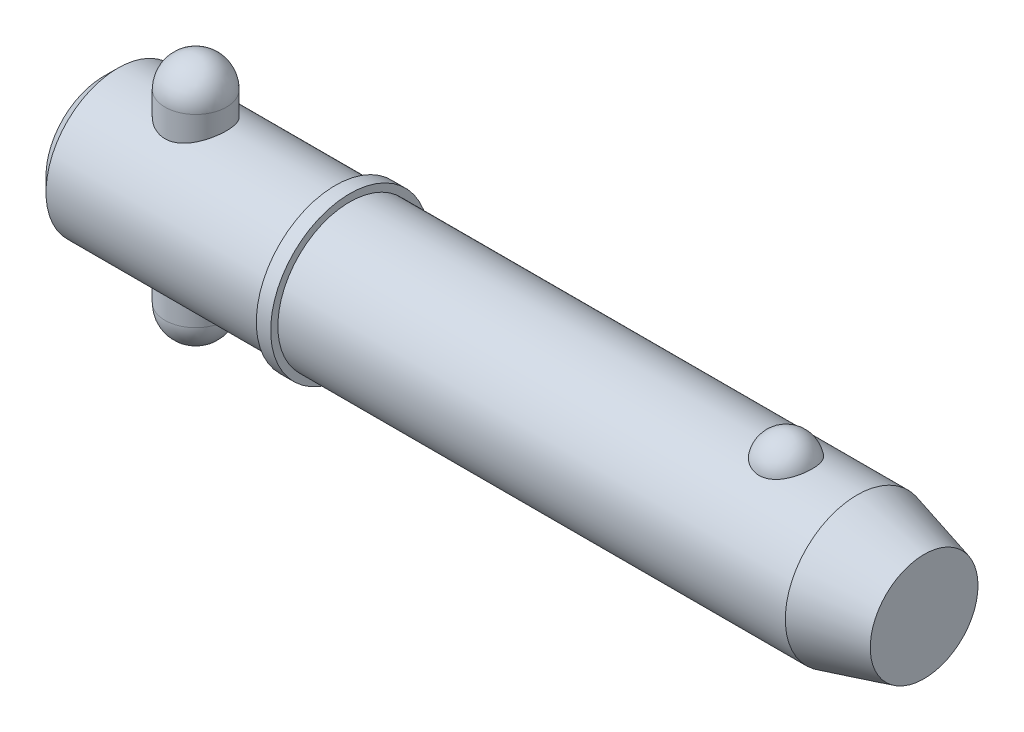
ISO-10303-21;
HEADER;
FILE_DESCRIPTION(('STEP AP214'),'2;1');
FILE_NAME('part.step','',(''),(''),'','','');
FILE_SCHEMA(('AUTOMOTIVE_DESIGN { 1 0 10303 214 1 1 1 1 }'));
ENDSEC;
DATA;
#1=APPLICATION_CONTEXT('core data for automotive mechanical design processes');
#2=APPLICATION_PROTOCOL_DEFINITION('international standard','automotive_design',2000,#1);
#3=PRODUCT_CONTEXT('',#1,'mechanical');
#4=PRODUCT('Part','Part','',(#3));
#5=PRODUCT_RELATED_PRODUCT_CATEGORY('part','',(#4));
#6=PRODUCT_DEFINITION_FORMATION('','',#4);
#7=PRODUCT_DEFINITION_CONTEXT('part definition',#1,'design');
#8=PRODUCT_DEFINITION('design','',#6,#7);
#9=PRODUCT_DEFINITION_SHAPE('','',#8);
#10=(LENGTH_UNIT() NAMED_UNIT(*) SI_UNIT(.MILLI.,.METRE.));
#11=(NAMED_UNIT(*) PLANE_ANGLE_UNIT() SI_UNIT($,.RADIAN.));
#12=(NAMED_UNIT(*) SI_UNIT($,.STERADIAN.) SOLID_ANGLE_UNIT());
#13=UNCERTAINTY_MEASURE_WITH_UNIT(LENGTH_MEASURE(1.E-05),#10,'distance_accuracy_value','');
#14=(GEOMETRIC_REPRESENTATION_CONTEXT(3) GLOBAL_UNCERTAINTY_ASSIGNED_CONTEXT((#13)) GLOBAL_UNIT_ASSIGNED_CONTEXT((#10,
#11,#12)) REPRESENTATION_CONTEXT('',''));
#15=CARTESIAN_POINT('',(0.,0.,0.));
#16=DIRECTION('',(0.,0.,1.));
#17=DIRECTION('',(1.,0.,0.));
#18=AXIS2_PLACEMENT_3D('',#15,#16,#17);
#19=CARTESIAN_POINT('',(14.28,19.05,0.));
#20=DIRECTION('',(0.,-1.,0.));
#21=DIRECTION('',(0.,0.,-1.));
#22=AXIS2_PLACEMENT_3D('',#19,#20,#21);
#23=CYLINDRICAL_SURFACE('',#22,4.76);
#24=CARTESIAN_POINT('',(14.28,-14.29,0.));
#25=DIRECTION('',(0.,-1.,0.));
#26=DIRECTION('',(0.,0.,-1.));
#27=AXIS2_PLACEMENT_3D('',#24,#25,#26);
#28=CIRCLE('',#27,4.76);
#29=CARTESIAN_POINT('',(14.28,-14.29,-4.76));
#30=VERTEX_POINT('',#29);
#31=EDGE_CURVE('P0_E10',#30,#30,#28,.F.);
#32=CARTESIAN_POINT('',(14.28,14.29,0.));
#33=DIRECTION('',(0.,-1.,0.));
#34=DIRECTION('',(0.,0.,-1.));
#35=AXIS2_PLACEMENT_3D('',#32,#33,#34);
#36=CIRCLE('',#35,4.76);
#37=CARTESIAN_POINT('',(14.28,14.29,-4.76));
#38=VERTEX_POINT('',#37);
#39=EDGE_CURVE('P0_E21',#38,#38,#36,.T.);
#40=CARTESIAN_POINT('',(14.28,-14.29,-4.76));
#41=CARTESIAN_POINT('',(14.28,-13.9922916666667,-4.76));
#42=CARTESIAN_POINT('',(14.28,-13.6945833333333,-4.76));
#43=CARTESIAN_POINT('',(14.28,-13.0991666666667,-4.76));
#44=CARTESIAN_POINT('',(14.28,-12.8014583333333,-4.76));
#45=CARTESIAN_POINT('',(14.28,-12.2060416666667,-4.76));
#46=CARTESIAN_POINT('',(14.28,-11.9083333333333,-4.76));
#47=CARTESIAN_POINT('',(14.28,-11.3129166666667,-4.76));
#48=CARTESIAN_POINT('',(14.28,-11.0152083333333,-4.76));
#49=CARTESIAN_POINT('',(14.28,-10.4197916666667,-4.76));
#50=CARTESIAN_POINT('',(14.28,-10.1220833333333,-4.76));
#51=CARTESIAN_POINT('',(14.28,-9.52666666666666,-4.76));
#52=CARTESIAN_POINT('',(14.28,-9.22895833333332,-4.76));
#53=CARTESIAN_POINT('',(14.28,-8.63354166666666,-4.76));
#54=CARTESIAN_POINT('',(14.28,-8.33583333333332,-4.76));
#55=CARTESIAN_POINT('',(14.28,-7.74041666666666,-4.76));
#56=CARTESIAN_POINT('',(14.28,-7.44270833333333,-4.76));
#57=CARTESIAN_POINT('',(14.28,-6.84729166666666,-4.76));
#58=CARTESIAN_POINT('',(14.28,-6.54958333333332,-4.76));
#59=CARTESIAN_POINT('',(14.28,-5.95416666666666,-4.76));
#60=CARTESIAN_POINT('',(14.28,-5.65645833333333,-4.76));
#61=CARTESIAN_POINT('',(14.28,-5.06104166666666,-4.76));
#62=CARTESIAN_POINT('',(14.28,-4.76333333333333,-4.76));
#63=CARTESIAN_POINT('',(14.28,-4.16791666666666,-4.76));
#64=CARTESIAN_POINT('',(14.28,-3.87020833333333,-4.76));
#65=CARTESIAN_POINT('',(14.28,-3.27479166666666,-4.76));
#66=CARTESIAN_POINT('',(14.28,-2.97708333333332,-4.76));
#67=CARTESIAN_POINT('',(14.28,-2.38166666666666,-4.76));
#68=CARTESIAN_POINT('',(14.28,-2.08395833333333,-4.76));
#69=CARTESIAN_POINT('',(14.28,-1.48854166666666,-4.76));
#70=CARTESIAN_POINT('',(14.28,-1.19083333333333,-4.76));
#71=CARTESIAN_POINT('',(14.28,-0.595416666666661,-4.76));
#72=CARTESIAN_POINT('',(14.28,-0.297708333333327,-4.76));
#73=CARTESIAN_POINT('',(14.28,0.297708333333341,-4.76));
#74=CARTESIAN_POINT('',(14.28,0.595416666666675,-4.76));
#75=CARTESIAN_POINT('',(14.28,1.19083333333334,-4.76));
#76=CARTESIAN_POINT('',(14.28,1.48854166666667,-4.76));
#77=CARTESIAN_POINT('',(14.28,2.08395833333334,-4.76));
#78=CARTESIAN_POINT('',(14.28,2.38166666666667,-4.76));
#79=CARTESIAN_POINT('',(14.28,2.97708333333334,-4.76));
#80=CARTESIAN_POINT('',(14.28,3.27479166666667,-4.76));
#81=CARTESIAN_POINT('',(14.28,3.87020833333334,-4.76));
#82=CARTESIAN_POINT('',(14.28,4.16791666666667,-4.76));
#83=CARTESIAN_POINT('',(14.28,4.76333333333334,-4.76));
#84=CARTESIAN_POINT('',(14.28,5.06104166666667,-4.76));
#85=CARTESIAN_POINT('',(14.28,5.65645833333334,-4.76));
#86=CARTESIAN_POINT('',(14.28,5.95416666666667,-4.76));
#87=CARTESIAN_POINT('',(14.28,6.54958333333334,-4.76));
#88=CARTESIAN_POINT('',(14.28,6.84729166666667,-4.76));
#89=CARTESIAN_POINT('',(14.28,7.44270833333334,-4.76));
#90=CARTESIAN_POINT('',(14.28,7.74041666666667,-4.76));
#91=CARTESIAN_POINT('',(14.28,8.33583333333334,-4.76));
#92=CARTESIAN_POINT('',(14.28,8.63354166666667,-4.76));
#93=CARTESIAN_POINT('',(14.28,9.22895833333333,-4.76));
#94=CARTESIAN_POINT('',(14.28,9.52666666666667,-4.76));
#95=CARTESIAN_POINT('',(14.28,10.1220833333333,-4.76));
#96=CARTESIAN_POINT('',(14.28,10.4197916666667,-4.76));
#97=CARTESIAN_POINT('',(14.28,11.0152083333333,-4.76));
#98=CARTESIAN_POINT('',(14.28,11.3129166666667,-4.76));
#99=CARTESIAN_POINT('',(14.28,11.9083333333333,-4.76));
#100=CARTESIAN_POINT('',(14.28,12.2060416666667,-4.76));
#101=CARTESIAN_POINT('',(14.28,12.8014583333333,-4.76));
#102=CARTESIAN_POINT('',(14.28,13.0991666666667,-4.76));
#103=CARTESIAN_POINT('',(14.28,13.6945833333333,-4.76));
#104=CARTESIAN_POINT('',(14.28,13.9922916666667,-4.76));
#105=CARTESIAN_POINT('',(14.28,14.29,-4.76));
#106=B_SPLINE_CURVE_WITH_KNOTS('',3,(#40,#41,#42,#43,#44,#45,#46,#47,#48,#49,#50,#51,#52,#53,
#54,#55,#56,#57,#58,#59,#60,#61,#62,#63,#64,#65,#66,#67,#68,#69,#70,#71,#72,#73,#74,#75,#76,#77,
#78,#79,#80,#81,#82,#83,#84,#85,#86,#87,#88,#89,#90,#91,#92,#93,#94,#95,#96,#97,#98,#99,#100,
#101,#102,#103,#104,#105),.UNSPECIFIED.,.F.,.F.,(4,2,2,2,2,2,2,2,2,2,2,2,2,2,2,2,2,2,2,2,2,2,2,
2,2,2,2,2,2,2,2,2,4),(0.,0.893125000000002,1.78625,2.67937499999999,3.5725,4.465625,5.35875,
6.25187499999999,7.145,8.038125,8.93125,9.82437499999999,10.7175,11.610625,12.50375,13.396875,
14.29,15.183125,16.07625,16.969375,17.8625,18.755625,19.64875,20.541875,21.435,22.328125,
23.22125,24.114375,25.0075,25.900625,26.79375,27.686875,28.58),.UNSPECIFIED.);
#107=EDGE_CURVE('P0_BSEAM14',#30,#38,#106,.T.);
#108=ORIENTED_EDGE('',*,*,#31,.T.);
#109=ORIENTED_EDGE('',*,*,#39,.T.);
#110=ORIENTED_EDGE('',*,*,#107,.T.);
#111=ORIENTED_EDGE('',*,*,#107,.F.);
#112=EDGE_LOOP('',(#108,#110,#109,#111));
#113=FACE_BOUND('',#112,.T.);
#114=ADVANCED_FACE('P0_F14',(#113),#23,.T.);
#115=CARTESIAN_POINT('',(14.28,-14.29,0.));
#116=DIRECTION('',(0.,0.,1.));
#117=DIRECTION('',(1.,0.,0.));
#118=AXIS2_PLACEMENT_3D('',#115,#116,#117);
#119=SPHERICAL_SURFACE('',#118,4.76);
#120=CARTESIAN_POINT('',(14.28,-14.29,0.));
#121=DIRECTION('',(0.,-1.,0.));
#122=DIRECTION('',(0.,0.,-1.));
#123=AXIS2_PLACEMENT_3D('',#120,#121,#122);
#124=SPHERICAL_SURFACE('',#123,4.76);
#125=ORIENTED_EDGE('',*,*,#31,.F.);
#126=EDGE_LOOP('',(#125));
#127=FACE_BOUND('',#126,.T.);
#128=ADVANCED_FACE('P0_F29',(#127),#124,.T.);
#129=CARTESIAN_POINT('',(14.28,14.29,0.));
#130=DIRECTION('',(0.,0.,1.));
#131=DIRECTION('',(1.,0.,0.));
#132=AXIS2_PLACEMENT_3D('',#129,#130,#131);
#133=SPHERICAL_SURFACE('',#132,4.76);
#134=CARTESIAN_POINT('',(14.28,14.29,0.));
#135=DIRECTION('',(0.,-1.,0.));
#136=DIRECTION('',(0.,0.,-1.));
#137=AXIS2_PLACEMENT_3D('',#134,#135,#136);
#138=SPHERICAL_SURFACE('',#137,4.76);
#139=ORIENTED_EDGE('',*,*,#39,.F.);
#140=EDGE_LOOP('',(#139));
#141=FACE_BOUND('',#140,.T.);
#142=ADVANCED_FACE('P0_F16',(#141),#138,.T.);
#143=CLOSED_SHELL('',(#114,#128,#142));
#144=MANIFOLD_SOLID_BREP('P0_B1',#143);
#145=CARTESIAN_POINT('',(0.,0.,0.));
#146=DIRECTION('',(1.,0.,0.));
#147=DIRECTION('',(0.,0.,-1.));
#148=AXIS2_PLACEMENT_3D('',#145,#146,#147);
#149=CYLINDRICAL_SURFACE('',#148,11.115);
#150=CARTESIAN_POINT('',(116.629563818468,0.,0.));
#151=DIRECTION('',(1.,0.,0.));
#152=DIRECTION('',(0.,0.,-1.));
#153=AXIS2_PLACEMENT_3D('',#150,#151,#152);
#154=CIRCLE('',#153,11.115);
#155=CARTESIAN_POINT('',(116.629563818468,0.,-11.115));
#156=VERTEX_POINT('',#155);
#157=EDGE_CURVE('P1_E81',#156,#156,#154,.T.);
#158=ORIENTED_EDGE('',*,*,#157,.F.);
#159=EDGE_LOOP('',(#158));
#160=FACE_BOUND('',#159,.T.);
#161=CARTESIAN_POINT('',(38.1,0.,0.));
#162=DIRECTION('',(1.,0.,0.));
#163=DIRECTION('',(0.,0.,-1.));
#164=AXIS2_PLACEMENT_3D('',#161,#162,#163);
#165=CIRCLE('',#164,11.115);
#166=CARTESIAN_POINT('',(38.1,0.,-11.115));
#167=VERTEX_POINT('',#166);
#168=EDGE_CURVE('P1_E85',#167,#167,#165,.T.);
#169=ORIENTED_EDGE('',*,*,#168,.T.);
#170=EDGE_LOOP('',(#169));
#171=FACE_BOUND('',#170,.T.);
#172=CARTESIAN_POINT('',(105.631068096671,10.3028087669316,4.17077409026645));
#173=CARTESIAN_POINT('',(105.414775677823,10.3028003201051,4.17078240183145));
#174=CARTESIAN_POINT('',(105.198548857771,10.3098895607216,4.15340593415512));
#175=CARTESIAN_POINT('',(104.772540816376,10.3373834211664,4.08449540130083));
#176=CARTESIAN_POINT('',(104.562757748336,10.3577841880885,4.03297121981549));
#177=CARTESIAN_POINT('',(104.155782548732,10.4095237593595,3.89746513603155));
#178=CARTESIAN_POINT('',(103.958572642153,10.4408466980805,3.81353029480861));
#179=CARTESIAN_POINT('',(103.581338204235,10.5110236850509,3.61560339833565));
#180=CARTESIAN_POINT('',(103.401317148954,10.5498792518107,3.50160528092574));
#181=CARTESIAN_POINT('',(103.057684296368,10.6322884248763,3.24292464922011));
#182=CARTESIAN_POINT('',(102.894686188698,10.6759443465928,3.09746040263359));
#183=CARTESIAN_POINT('',(102.594591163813,10.7625291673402,2.78171925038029));
#184=CARTESIAN_POINT('',(102.457499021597,10.8054579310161,2.61143778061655));
#185=CARTESIAN_POINT('',(102.206408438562,10.8881935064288,2.24226695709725));
#186=CARTESIAN_POINT('',(102.093710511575,10.9277761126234,2.04244123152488));
#187=CARTESIAN_POINT('',(101.901777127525,10.997484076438,1.62578254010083));
#188=CARTESIAN_POINT('',(101.822544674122,11.0276085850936,1.40894804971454));
#189=CARTESIAN_POINT('',(101.698303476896,11.0756732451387,0.961250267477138));
#190=CARTESIAN_POINT('',(101.653760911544,11.0934470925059,0.730239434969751));
#191=CARTESIAN_POINT('',(101.601569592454,11.1143331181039,0.263439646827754));
#192=CARTESIAN_POINT('',(101.593920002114,11.1174456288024,0.0276507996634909));
#193=CARTESIAN_POINT('',(101.61561056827,11.1087161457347,-0.440729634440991));
#194=CARTESIAN_POINT('',(101.644762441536,11.0969502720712,-0.673331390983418));
#195=CARTESIAN_POINT('',(101.739143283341,11.0597872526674,-1.12996621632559));
#196=CARTESIAN_POINT('',(101.804372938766,11.0343898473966,-1.35399912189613));
#197=CARTESIAN_POINT('',(101.96969844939,10.972515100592,-1.78750286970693));
#198=CARTESIAN_POINT('',(102.06983863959,10.9360236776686,-1.99695478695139));
#199=CARTESIAN_POINT('',(102.302940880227,10.8557595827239,-2.3952066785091));
#200=CARTESIAN_POINT('',(102.435905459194,10.8119863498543,-2.5840050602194));
#201=CARTESIAN_POINT('',(102.732407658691,10.7216733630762,-2.93635726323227));
#202=CARTESIAN_POINT('',(102.896056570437,10.675123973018,-3.09981510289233));
#203=CARTESIAN_POINT('',(103.249860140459,10.5846571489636,-3.39592247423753));
#204=CARTESIAN_POINT('',(103.440012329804,10.5407394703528,-3.52857487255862));
#205=CARTESIAN_POINT('',(103.83750141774,10.4616690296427,-3.75646057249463));
#206=CARTESIAN_POINT('',(104.04436705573,10.4263443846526,-3.85245432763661));
#207=CARTESIAN_POINT('',(104.472954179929,10.3675574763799,-4.00798747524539));
#208=CARTESIAN_POINT('',(104.694670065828,10.3440907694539,-4.06754052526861));
#209=CARTESIAN_POINT('',(105.134669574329,10.3128282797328,-4.14614314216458));
#210=CARTESIAN_POINT('',(105.352565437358,10.3043040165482,-4.1670783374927));
#211=CARTESIAN_POINT('',(105.78894951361,10.3016771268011,-4.17357158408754));
#212=CARTESIAN_POINT('',(106.007437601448,10.3075716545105,-4.15913661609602));
#213=CARTESIAN_POINT('',(106.431744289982,10.3326686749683,-4.09636961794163));
#214=CARTESIAN_POINT('',(106.637745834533,10.3514555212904,-4.0490957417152));
#215=CARTESIAN_POINT('',(107.038576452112,10.399818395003,-3.92320197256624));
#216=CARTESIAN_POINT('',(107.2334046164,10.4293952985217,-3.84457953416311));
#217=CARTESIAN_POINT('',(107.611191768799,10.4969600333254,-3.65612410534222));
#218=CARTESIAN_POINT('',(107.793797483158,10.5351178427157,-3.54564545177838));
#219=CARTESIAN_POINT('',(108.138204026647,10.6154999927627,-3.29718036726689));
#220=CARTESIAN_POINT('',(108.300000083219,10.657725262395,-3.15918764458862));
#221=CARTESIAN_POINT('',(108.606959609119,10.744212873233,-2.85163580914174));
#222=CARTESIAN_POINT('',(108.750891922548,10.7884718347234,-2.68084605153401));
#223=CARTESIAN_POINT('',(109.009237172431,10.872374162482,-2.31721864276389));
#224=CARTESIAN_POINT('',(109.123644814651,10.9120167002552,-2.12437704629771));
#225=CARTESIAN_POINT('',(109.323873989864,10.9838919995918,-1.71516999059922));
#226=CARTESIAN_POINT('',(109.40866178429,11.0158465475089,-1.498248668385));
#227=CARTESIAN_POINT('',(109.54268382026,11.0673523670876,-1.052285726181));
#228=CARTESIAN_POINT('',(109.591917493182,11.086903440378,-0.823243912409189));
#229=CARTESIAN_POINT('',(109.653891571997,11.1116323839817,-0.359087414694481));
#230=CARTESIAN_POINT('',(109.666566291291,11.1167843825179,-0.123962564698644));
#231=CARTESIAN_POINT('',(109.654973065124,11.1121144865,0.345220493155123));
#232=CARTESIAN_POINT('',(109.630705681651,11.1022928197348,0.579278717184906));
#233=CARTESIAN_POINT('',(109.545907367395,11.0687504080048,1.03866534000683));
#234=CARTESIAN_POINT('',(109.485529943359,11.0450885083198,1.26402641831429));
#235=CARTESIAN_POINT('',(109.329853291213,10.9863185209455,1.70076772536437));
#236=CARTESIAN_POINT('',(109.234551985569,10.9512097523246,1.91214712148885));
#237=CARTESIAN_POINT('',(109.010397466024,10.8729733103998,2.31608359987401));
#238=CARTESIAN_POINT('',(108.881380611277,10.8298068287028,2.50854240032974));
#239=CARTESIAN_POINT('',(108.592732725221,10.7401896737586,2.86808766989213));
#240=CARTESIAN_POINT('',(108.433102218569,10.6937390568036,3.03517457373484));
#241=CARTESIAN_POINT('',(108.087534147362,10.6029321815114,3.33857581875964));
#242=CARTESIAN_POINT('',(107.901708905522,10.5585680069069,3.47501541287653));
#243=CARTESIAN_POINT('',(107.507875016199,10.4769321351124,3.71390897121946));
#244=CARTESIAN_POINT('',(107.299863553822,10.439661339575,3.81635861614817));
#245=CARTESIAN_POINT('',(106.854066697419,10.3749407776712,3.98910631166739));
#246=CARTESIAN_POINT('',(106.615234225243,10.3482457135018,4.05700929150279));
#247=CARTESIAN_POINT('',(106.127925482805,10.312188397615,4.14782844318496));
#248=CARTESIAN_POINT('',(105.879453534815,10.3028184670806,4.17076454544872));
#249=CARTESIAN_POINT('',(105.631068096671,10.3028087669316,4.17077409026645));
#250=B_SPLINE_CURVE_WITH_KNOTS('',3,(#172,#173,#174,#175,#176,#177,#178,#179,#180,#181,#182,
#183,#184,#185,#186,#187,#188,#189,#190,#191,#192,#193,#194,#195,#196,#197,#198,#199,#200,#201,
#202,#203,#204,#205,#206,#207,#208,#209,#210,#211,#212,#213,#214,#215,#216,#217,#218,#219,#220,
#221,#222,#223,#224,#225,#226,#227,#228,#229,#230,#231,#232,#233,#234,#235,#236,#237,#238,#239,
#240,#241,#242,#243,#244,#245,#246,#247,#248,#249),.UNSPECIFIED.,.T.,.F.,(4,2,2,2,2,2,2,2,2,2,2,
2,2,2,2,2,2,2,2,2,2,2,2,2,2,2,2,2,2,2,2,2,2,2,2,2,2,2,4),(0.,0.647966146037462,1.29574482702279,
1.94258643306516,2.58955857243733,3.25496465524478,3.92049326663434,4.61566368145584,
5.31089647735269,6.01531821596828,6.71972398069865,7.42054043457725,8.12137023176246,
8.82309331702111,9.52487047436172,10.2292439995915,10.9335519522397,11.6223330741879,
12.3108558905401,12.9647664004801,13.6185478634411,14.2521847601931,14.8858731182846,
15.5334360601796,16.1811472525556,16.8611459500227,17.5412664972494,18.2431855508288,
18.9451158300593,19.6483065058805,20.3514864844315,21.0516982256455,21.7519516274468,
22.4556690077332,23.1593743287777,23.8601491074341,24.5610129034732,25.3054529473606,
26.049562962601),.UNSPECIFIED.);
#251=CARTESIAN_POINT('',(105.631068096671,10.3028087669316,4.17077409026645));
#252=VERTEX_POINT('',#251);
#253=EDGE_CURVE('P1_E35',#252,#252,#250,.T.);
#254=ORIENTED_EDGE('',*,*,#253,.T.);
#255=EDGE_LOOP('',(#254));
#256=FACE_BOUND('',#255,.T.);
#257=ADVANCED_FACE('P1_F13',(#160,#171,#256),#149,.T.);
#258=CARTESIAN_POINT('',(0.,0.,0.));
#259=DIRECTION('',(-1.,0.,0.));
#260=DIRECTION('',(0.,0.,1.));
#261=AXIS2_PLACEMENT_3D('',#258,#259,#260);
#262=PLANE('',#261);
#263=CARTESIAN_POINT('',(0.,0.,0.));
#264=DIRECTION('',(1.,0.,0.));
#265=DIRECTION('',(0.,0.,-1.));
#266=AXIS2_PLACEMENT_3D('',#263,#264,#265);
#267=CIRCLE('',#266,8.892);
#268=CARTESIAN_POINT('',(0.,0.,-8.892));
#269=VERTEX_POINT('',#268);
#270=EDGE_CURVE('P1_E9',#269,#269,#267,.T.);
#271=ORIENTED_EDGE('',*,*,#270,.F.);
#272=EDGE_LOOP('',(#271));
#273=FACE_BOUND('',#272,.T.);
#274=ADVANCED_FACE('P1_F15',(#273),#262,.T.);
#275=CARTESIAN_POINT('',(2.22299999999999,0.,0.));
#276=DIRECTION('',(1.,0.,0.));
#277=DIRECTION('',(0.,0.,-1.));
#278=AXIS2_PLACEMENT_3D('',#275,#276,#277);
#279=CONICAL_SURFACE('',#278,11.115,0.78539816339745);
#280=ORIENTED_EDGE('',*,*,#270,.T.);
#281=EDGE_LOOP('',(#280));
#282=FACE_BOUND('',#281,.T.);
#283=CARTESIAN_POINT('',(2.22299999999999,0.,0.));
#284=DIRECTION('',(1.,0.,0.));
#285=DIRECTION('',(0.,0.,-1.));
#286=AXIS2_PLACEMENT_3D('',#283,#284,#285);
#287=CIRCLE('',#286,11.115);
#288=CARTESIAN_POINT('',(2.22299999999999,0.,-11.115));
#289=VERTEX_POINT('',#288);
#290=EDGE_CURVE('P1_E26',#289,#289,#287,.T.);
#291=ORIENTED_EDGE('',*,*,#290,.F.);
#292=EDGE_LOOP('',(#291));
#293=FACE_BOUND('',#292,.T.);
#294=ADVANCED_FACE('P1_F77',(#282,#293),#279,.T.);
#295=CARTESIAN_POINT('',(0.,0.,0.));
#296=DIRECTION('',(1.,0.,0.));
#297=DIRECTION('',(0.,0.,-1.));
#298=AXIS2_PLACEMENT_3D('',#295,#296,#297);
#299=CYLINDRICAL_SURFACE('',#298,11.115);
#300=CARTESIAN_POINT('',(14.28,-10.0441836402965,4.76));
#301=CARTESIAN_POINT('',(14.1533731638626,-10.0441846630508,4.75999904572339));
#302=CARTESIAN_POINT('',(14.0267055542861,-10.0465865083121,4.75493985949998));
#303=CARTESIAN_POINT('',(13.774298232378,-10.0561141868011,4.73475585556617));
#304=CARTESIAN_POINT('',(13.6485591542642,-10.0632429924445,4.71962470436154));
#305=CARTESIAN_POINT('',(13.3987500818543,-10.0819979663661,4.67942666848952));
#306=CARTESIAN_POINT('',(13.2746840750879,-10.0936334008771,4.65433930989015));
#307=CARTESIAN_POINT('',(13.0293244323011,-10.1210146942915,4.59449317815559));
#308=CARTESIAN_POINT('',(12.9080319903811,-10.1367622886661,4.55973032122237));
#309=CARTESIAN_POINT('',(12.669614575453,-10.1717810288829,4.48106435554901));
#310=CARTESIAN_POINT('',(12.5524727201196,-10.1910352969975,4.4372048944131));
#311=CARTESIAN_POINT('',(12.3224300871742,-10.2325403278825,4.34063417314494));
#312=CARTESIAN_POINT('',(12.2095309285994,-10.2547922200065,4.28791957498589));
#313=CARTESIAN_POINT('',(11.8782785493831,-10.3250879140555,4.11715127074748));
#314=CARTESIAN_POINT('',(11.6670799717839,-10.3767168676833,3.98637638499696));
#315=CARTESIAN_POINT('',(11.2564039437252,-10.4874309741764,3.68567149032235));
#316=CARTESIAN_POINT('',(11.0583793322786,-10.5467772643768,3.51386978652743));
#317=CARTESIAN_POINT('',(10.6927724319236,-10.6641377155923,3.13969960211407));
#318=CARTESIAN_POINT('',(10.5252022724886,-10.7221513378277,2.93731900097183));
#319=CARTESIAN_POINT('',(10.2965609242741,-10.8050020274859,2.60935726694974));
#320=CARTESIAN_POINT('',(10.2227768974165,-10.8324811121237,2.49310321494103));
#321=CARTESIAN_POINT('',(10.0853380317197,-10.884703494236,2.25418999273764));
#322=CARTESIAN_POINT('',(10.0216789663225,-10.9094479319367,2.13153352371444));
#323=CARTESIAN_POINT('',(9.90506238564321,-10.9554932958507,1.88060370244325));
#324=CARTESIAN_POINT('',(9.85210574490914,-10.9767939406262,1.7523298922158));
#325=CARTESIAN_POINT('',(9.75746464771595,-11.0153112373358,1.49115740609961));
#326=CARTESIAN_POINT('',(9.71577447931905,-11.0325299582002,1.35826111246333));
#327=CARTESIAN_POINT('',(9.64605475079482,-11.0615607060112,1.09614539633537));
#328=CARTESIAN_POINT('',(9.61740732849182,-11.0736151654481,0.96711700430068));
#329=CARTESIAN_POINT('',(9.57092026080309,-11.0932687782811,0.706847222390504));
#330=CARTESIAN_POINT('',(9.55307574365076,-11.1008699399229,0.575606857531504));
#331=CARTESIAN_POINT('',(9.52838640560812,-11.1114054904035,0.31192917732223));
#332=CARTESIAN_POINT('',(9.52153986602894,-11.114340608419,0.179492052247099));
#333=CARTESIAN_POINT('',(9.51892405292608,-11.1154607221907,-0.0855090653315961));
#334=CARTESIAN_POINT('',(9.52315432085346,-11.1136459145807,-0.218073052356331));
#335=CARTESIAN_POINT('',(9.542009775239,-11.1055891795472,-0.473709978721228));
#336=CARTESIAN_POINT('',(9.55594693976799,-11.099640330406,-0.596843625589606));
#337=CARTESIAN_POINT('',(9.59332832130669,-11.0837823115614,-0.841440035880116));
#338=CARTESIAN_POINT('',(9.61677567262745,-11.0738718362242,-0.962902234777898));
#339=CARTESIAN_POINT('',(9.67294089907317,-11.0503378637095,-1.20325684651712));
#340=CARTESIAN_POINT('',(9.70565569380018,-11.0367156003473,-1.32215009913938));
#341=CARTESIAN_POINT('',(9.78005008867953,-11.0060908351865,-1.55666640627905));
#342=CARTESIAN_POINT('',(9.82173311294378,-10.9890870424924,-1.67228819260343));
#343=CARTESIAN_POINT('',(9.96110379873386,-10.9330280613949,-2.01656166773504));
#344=CARTESIAN_POINT('',(10.0722987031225,-10.8892801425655,-2.23915547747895));
#345=CARTESIAN_POINT('',(10.3268588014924,-10.7934745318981,-2.66299199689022));
#346=CARTESIAN_POINT('',(10.4702355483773,-10.7414138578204,-2.86422700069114));
#347=CARTESIAN_POINT('',(10.7973904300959,-10.6296201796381,-3.25557775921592));
#348=CARTESIAN_POINT('',(10.9833705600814,-10.569604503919,-3.443774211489));
#349=CARTESIAN_POINT('',(11.3844486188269,-10.4514707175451,-3.78722133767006));
#350=CARTESIAN_POINT('',(11.5995590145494,-10.3933534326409,-3.94245783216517));
#351=CARTESIAN_POINT('',(11.9444340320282,-10.311516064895,-4.14990014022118));
#352=CARTESIAN_POINT('',(12.0654579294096,-10.2847012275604,-4.21573894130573));
#353=CARTESIAN_POINT('',(12.3132718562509,-10.2342051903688,-4.33688518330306));
#354=CARTESIAN_POINT('',(12.4400593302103,-10.2105226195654,-4.39219723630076));
#355=CARTESIAN_POINT('',(12.6985418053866,-10.1671237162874,-4.49174500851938));
#356=CARTESIAN_POINT('',(12.8302359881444,-10.1474067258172,-4.53598256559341));
#357=CARTESIAN_POINT('',(13.0975061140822,-10.1126841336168,-4.61287629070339));
#358=CARTESIAN_POINT('',(13.233079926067,-10.0976759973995,-4.64553869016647));
#359=CARTESIAN_POINT('',(13.4978553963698,-10.0737863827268,-4.6971059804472));
#360=CARTESIAN_POINT('',(13.6268754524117,-10.0645618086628,-4.716785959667));
#361=CARTESIAN_POINT('',(13.8862990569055,-10.051062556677,-4.74548419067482));
#362=CARTESIAN_POINT('',(14.0167019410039,-10.0467856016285,-4.75450734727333));
#363=CARTESIAN_POINT('',(14.277859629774,-10.0433352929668,-4.76179143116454));
#364=CARTESIAN_POINT('',(14.4086143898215,-10.0441613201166,-4.76005366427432));
#365=CARTESIAN_POINT('',(14.6694025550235,-10.0508838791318,-4.74584231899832));
#366=CARTESIAN_POINT('',(14.7994359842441,-10.0567802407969,-4.73336910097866));
#367=CARTESIAN_POINT('',(15.0487369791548,-10.0728449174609,-4.69907984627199));
#368=CARTESIAN_POINT('',(15.1681238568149,-10.0826872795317,-4.67797462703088));
#369=CARTESIAN_POINT('',(15.4045894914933,-10.1062580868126,-4.62682977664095));
#370=CARTESIAN_POINT('',(15.5216674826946,-10.1199877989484,-4.59678723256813));
#371=CARTESIAN_POINT('',(15.868278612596,-10.1664161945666,-4.49365911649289));
#372=CARTESIAN_POINT('',(16.0933756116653,-10.2043671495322,-4.40754694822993));
#373=CARTESIAN_POINT('',(16.5357981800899,-10.2919879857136,-4.19898201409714));
#374=CARTESIAN_POINT('',(16.7523611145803,-10.3420954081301,-4.07511281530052));
#375=CARTESIAN_POINT('',(17.1627188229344,-10.4477911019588,-3.7959429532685));
#376=CARTESIAN_POINT('',(17.3565033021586,-10.5033818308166,-3.64062816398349));
#377=CARTESIAN_POINT('',(17.7334034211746,-10.6196376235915,-3.28693729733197));
#378=CARTESIAN_POINT('',(17.9141276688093,-10.6803237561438,-3.08599175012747));
#379=CARTESIAN_POINT('',(18.1582189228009,-10.7666348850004,-2.76320365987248));
#380=CARTESIAN_POINT('',(18.2351223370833,-10.7946346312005,-2.65197124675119));
#381=CARTESIAN_POINT('',(18.3793967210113,-10.8483267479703,-2.42297927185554));
#382=CARTESIAN_POINT('',(18.4467718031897,-10.87402011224,-2.30522255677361));
#383=CARTESIAN_POINT('',(18.5717669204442,-10.9225249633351,-2.06324665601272));
#384=CARTESIAN_POINT('',(18.6293326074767,-10.9453202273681,-1.93899615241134));
#385=CARTESIAN_POINT('',(18.73370006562,-10.9872100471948,-1.6855059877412));
#386=CARTESIAN_POINT('',(18.7805065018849,-11.0063062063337,-1.55626851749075));
#387=CARTESIAN_POINT('',(18.8628731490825,-11.0402419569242,-1.29375150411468));
#388=CARTESIAN_POINT('',(18.8984366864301,-11.0550828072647,-1.16047316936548));
#389=CARTESIAN_POINT('',(18.9579183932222,-11.0800638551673,-0.890912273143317));
#390=CARTESIAN_POINT('',(18.9818374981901,-11.0902044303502,-0.75462995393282));
#391=CARTESIAN_POINT('',(19.0164177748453,-11.104911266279,-0.490295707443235));
#392=CARTESIAN_POINT('',(19.027922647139,-11.1098318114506,-0.362373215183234));
#393=CARTESIAN_POINT('',(19.040554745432,-11.1152360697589,-0.105876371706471));
#394=CARTESIAN_POINT('',(19.0416784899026,-11.1157182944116,0.0226981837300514));
#395=CARTESIAN_POINT('',(19.0335275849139,-11.1122291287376,0.27938352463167));
#396=CARTESIAN_POINT('',(19.0242587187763,-11.1082602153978,0.407494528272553));
#397=CARTESIAN_POINT('',(18.9954320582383,-11.0959792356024,0.662388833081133));
#398=CARTESIAN_POINT('',(18.9758704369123,-11.0876655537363,0.789171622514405));
#399=CARTESIAN_POINT('',(18.9276379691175,-11.0673259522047,1.03545890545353));
#400=CARTESIAN_POINT('',(18.8993573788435,-11.0554596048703,1.15505309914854));
#401=CARTESIAN_POINT('',(18.8337694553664,-11.0282166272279,1.39134516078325));
#402=CARTESIAN_POINT('',(18.7964589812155,-11.0128387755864,1.5080420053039));
#403=CARTESIAN_POINT('',(18.671464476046,-10.9619666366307,1.85262797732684));
#404=CARTESIAN_POINT('',(18.5706772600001,-10.9217161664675,2.07521484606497));
#405=CARTESIAN_POINT('',(18.33202463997,-10.8301378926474,2.51061719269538));
#406=CARTESIAN_POINT('',(18.1926775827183,-10.7783885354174,2.72252375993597));
#407=CARTESIAN_POINT('',(17.8829747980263,-10.669863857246,3.12088015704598));
#408=CARTESIAN_POINT('',(17.7126068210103,-10.6130865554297,3.30731987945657));
#409=CARTESIAN_POINT('',(17.3310036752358,-10.495668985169,3.66358491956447));
#410=CARTESIAN_POINT('',(17.1177010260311,-10.4350471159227,3.83122543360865));
#411=CARTESIAN_POINT('',(16.7778915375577,-10.3495418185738,4.05420569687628));
#412=CARTESIAN_POINT('',(16.6612023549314,-10.3219229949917,4.12383380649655));
#413=CARTESIAN_POINT('',(16.4218466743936,-10.2693487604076,4.25306463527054));
#414=CARTESIAN_POINT('',(16.2991829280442,-10.2443921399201,4.31267191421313));
#415=CARTESIAN_POINT('',(16.0488008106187,-10.1979981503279,4.42126071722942));
#416=CARTESIAN_POINT('',(15.9210894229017,-10.1765561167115,4.47025635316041));
#417=CARTESIAN_POINT('',(15.6613937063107,-10.1379191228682,4.55720152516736));
#418=CARTESIAN_POINT('',(15.5294115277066,-10.1207220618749,4.59515652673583));
#419=CARTESIAN_POINT('',(15.2624981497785,-10.091252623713,4.65951684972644));
#420=CARTESIAN_POINT('',(15.1275757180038,-10.0789672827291,4.68595259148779));
#421=CARTESIAN_POINT('',(14.8556442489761,-10.0597530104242,4.72706206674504));
#422=CARTESIAN_POINT('',(14.7186368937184,-10.0528199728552,4.74174481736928));
#423=CARTESIAN_POINT('',(14.5310955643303,-10.047196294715,4.75363843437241));
#424=CARTESIAN_POINT('',(14.48091543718,-10.0460674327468,4.75602323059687));
#425=CARTESIAN_POINT('',(14.3804923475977,-10.044560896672,4.7592042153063));
#426=CARTESIAN_POINT('',(14.3302493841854,-10.0441832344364,4.76000037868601));
#427=CARTESIAN_POINT('',(14.28,-10.0441836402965,4.76));
#428=B_SPLINE_CURVE_WITH_KNOTS('',3,(#300,#301,#302,#303,#304,#305,#306,#307,#308,#309,#310,
#311,#312,#313,#314,#315,#316,#317,#318,#319,#320,#321,#322,#323,#324,#325,#326,#327,#328,#329,
#330,#331,#332,#333,#334,#335,#336,#337,#338,#339,#340,#341,#342,#343,#344,#345,#346,#347,#348,
#349,#350,#351,#352,#353,#354,#355,#356,#357,#358,#359,#360,#361,#362,#363,#364,#365,#366,#367,
#368,#369,#370,#371,#372,#373,#374,#375,#376,#377,#378,#379,#380,#381,#382,#383,#384,#385,#386,
#387,#388,#389,#390,#391,#392,#393,#394,#395,#396,#397,#398,#399,#400,#401,#402,#403,#404,#405,
#406,#407,#408,#409,#410,#411,#412,#413,#414,#415,#416,#417,#418,#419,#420,#421,#422,#423,#424,
#425,#426,#427),.UNSPECIFIED.,.T.,.F.,(4,2,2,2,2,2,2,2,2,2,2,2,2,2,2,2,2,2,2,2,2,2,2,2,2,2,2,2,
2,2,2,2,2,2,2,2,2,2,2,2,2,2,2,2,2,2,2,2,2,2,2,2,2,2,2,2,2,2,2,2,2,2,2,4),(0.,0.379828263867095,
0.759895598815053,1.14074858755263,1.52176256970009,1.90098898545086,2.28035867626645,
3.03818035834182,3.84125131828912,4.6446414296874,5.06541657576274,5.48601561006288,
5.90664899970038,6.3270687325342,6.72470503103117,7.12216187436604,7.51955659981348,
7.91693487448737,8.28868404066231,8.66055582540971,9.03230414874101,9.40419465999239,
10.1585834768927,10.9132435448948,11.7236471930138,12.5343987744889,12.9550196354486,
13.3754557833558,13.7958221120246,14.2159617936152,14.6079540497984,14.9997658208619,
15.3915300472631,15.7832811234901,16.1477615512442,16.512360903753,17.240999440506,
18.0012974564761,18.761937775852,19.5886929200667,20.0025782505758,20.4162843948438,
20.832212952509,21.2479608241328,21.6635855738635,22.0791769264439,22.4642880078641,
22.8495282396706,23.2345541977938,23.6197234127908,23.9896813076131,24.3597680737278,
25.099327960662,25.8726239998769,26.6462260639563,27.4759193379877,27.8914891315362,
28.3068693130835,28.7216936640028,29.1363123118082,29.5498292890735,29.9630287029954,
30.113753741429,30.2644811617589),.UNSPECIFIED.);
#429=CARTESIAN_POINT('',(14.28,-10.0441836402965,4.76));
#430=VERTEX_POINT('',#429);
#431=EDGE_CURVE('P1_E17',#430,#430,#428,.T.);
#432=ORIENTED_EDGE('',*,*,#431,.F.);
#433=EDGE_LOOP('',(#432));
#434=FACE_BOUND('',#433,.T.);
#435=CARTESIAN_POINT('',(14.28,10.0441836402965,4.76));
#436=CARTESIAN_POINT('',(14.4066268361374,10.0441846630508,4.75999904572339));
#437=CARTESIAN_POINT('',(14.5332944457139,10.0465865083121,4.75493985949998));
#438=CARTESIAN_POINT('',(14.785701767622,10.0561141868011,4.73475585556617));
#439=CARTESIAN_POINT('',(14.9114408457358,10.0632429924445,4.71962470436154));
#440=CARTESIAN_POINT('',(15.1612499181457,10.0819979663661,4.67942666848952));
#441=CARTESIAN_POINT('',(15.2853159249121,10.0936334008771,4.65433930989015));
#442=CARTESIAN_POINT('',(15.5306755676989,10.1210146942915,4.59449317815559));
#443=CARTESIAN_POINT('',(15.6519680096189,10.1367622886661,4.55973032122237));
#444=CARTESIAN_POINT('',(15.890385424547,10.1717810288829,4.48106435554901));
#445=CARTESIAN_POINT('',(16.0075272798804,10.1910352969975,4.4372048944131));
#446=CARTESIAN_POINT('',(16.2375699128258,10.2325403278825,4.34063417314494));
#447=CARTESIAN_POINT('',(16.3504690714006,10.2547922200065,4.28791957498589));
#448=CARTESIAN_POINT('',(16.6817214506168,10.3250879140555,4.11715127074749));
#449=CARTESIAN_POINT('',(16.8929200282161,10.3767168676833,3.98637638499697));
#450=CARTESIAN_POINT('',(17.3035960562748,10.4874309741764,3.68567149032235));
#451=CARTESIAN_POINT('',(17.5016206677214,10.5467772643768,3.51386978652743));
#452=CARTESIAN_POINT('',(17.8672275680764,10.6641377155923,3.13969960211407));
#453=CARTESIAN_POINT('',(18.0347977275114,10.7221513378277,2.93731900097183));
#454=CARTESIAN_POINT('',(18.2634390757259,10.8050020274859,2.60935726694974));
#455=CARTESIAN_POINT('',(18.3372231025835,10.8324811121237,2.49310321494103));
#456=CARTESIAN_POINT('',(18.4746619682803,10.884703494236,2.25418999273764));
#457=CARTESIAN_POINT('',(18.5383210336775,10.9094479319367,2.13153352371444));
#458=CARTESIAN_POINT('',(18.6549376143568,10.9554932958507,1.88060370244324));
#459=CARTESIAN_POINT('',(18.7078942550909,10.9767939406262,1.75232989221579));
#460=CARTESIAN_POINT('',(18.8025353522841,11.0153112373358,1.4911574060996));
#461=CARTESIAN_POINT('',(18.844225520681,11.0325299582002,1.35826111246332));
#462=CARTESIAN_POINT('',(18.9139452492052,11.0615607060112,1.09614539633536));
#463=CARTESIAN_POINT('',(18.9425926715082,11.0736151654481,0.967117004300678));
#464=CARTESIAN_POINT('',(18.9890797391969,11.0932687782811,0.706847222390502));
#465=CARTESIAN_POINT('',(19.0069242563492,11.1008699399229,0.575606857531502));
#466=CARTESIAN_POINT('',(19.0316135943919,11.1114054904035,0.311929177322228));
#467=CARTESIAN_POINT('',(19.0384601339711,11.114340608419,0.179492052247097));
#468=CARTESIAN_POINT('',(19.0410759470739,11.1154607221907,-0.0855090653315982));
#469=CARTESIAN_POINT('',(19.0368456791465,11.1136459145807,-0.218073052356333));
#470=CARTESIAN_POINT('',(19.017990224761,11.1055891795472,-0.47370997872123));
#471=CARTESIAN_POINT('',(19.004053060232,11.099640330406,-0.596843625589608));
#472=CARTESIAN_POINT('',(18.9666716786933,11.0837823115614,-0.841440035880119));
#473=CARTESIAN_POINT('',(18.9432243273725,11.0738718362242,-0.9629022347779));
#474=CARTESIAN_POINT('',(18.8870591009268,11.0503378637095,-1.20325684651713));
#475=CARTESIAN_POINT('',(18.8543443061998,11.0367156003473,-1.32215009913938));
#476=CARTESIAN_POINT('',(18.7799499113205,11.0060908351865,-1.55666640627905));
#477=CARTESIAN_POINT('',(18.7382668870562,10.9890870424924,-1.67228819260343));
#478=CARTESIAN_POINT('',(18.5988962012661,10.9330280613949,-2.01656166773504));
#479=CARTESIAN_POINT('',(18.4877012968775,10.8892801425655,-2.23915547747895));
#480=CARTESIAN_POINT('',(18.2331411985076,10.7934745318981,-2.66299199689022));
#481=CARTESIAN_POINT('',(18.0897644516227,10.7414138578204,-2.86422700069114));
#482=CARTESIAN_POINT('',(17.7626095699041,10.6296201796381,-3.25557775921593));
#483=CARTESIAN_POINT('',(17.5766294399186,10.569604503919,-3.443774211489));
#484=CARTESIAN_POINT('',(17.1755513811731,10.4514707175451,-3.78722133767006));
#485=CARTESIAN_POINT('',(16.9604409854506,10.3933534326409,-3.94245783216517));
#486=CARTESIAN_POINT('',(16.6155659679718,10.311516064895,-4.14990014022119));
#487=CARTESIAN_POINT('',(16.4945420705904,10.2847012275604,-4.21573894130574));
#488=CARTESIAN_POINT('',(16.2467281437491,10.2342051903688,-4.33688518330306));
#489=CARTESIAN_POINT('',(16.1199406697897,10.2105226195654,-4.39219723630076));
#490=CARTESIAN_POINT('',(15.8614581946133,10.1671237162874,-4.49174500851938));
#491=CARTESIAN_POINT('',(15.7297640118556,10.1474067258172,-4.53598256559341));
#492=CARTESIAN_POINT('',(15.4624938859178,10.1126841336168,-4.61287629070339));
#493=CARTESIAN_POINT('',(15.326920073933,10.0976759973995,-4.64553869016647));
#494=CARTESIAN_POINT('',(15.0621446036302,10.0737863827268,-4.6971059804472));
#495=CARTESIAN_POINT('',(14.9331245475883,10.0645618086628,-4.716785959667));
#496=CARTESIAN_POINT('',(14.6737009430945,10.051062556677,-4.74548419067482));
#497=CARTESIAN_POINT('',(14.543298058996,10.0467856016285,-4.75450734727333));
#498=CARTESIAN_POINT('',(14.2821403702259,10.0433352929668,-4.76179143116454));
#499=CARTESIAN_POINT('',(14.1513856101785,10.0441613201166,-4.76005366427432));
#500=CARTESIAN_POINT('',(13.8905974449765,10.0508838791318,-4.74584231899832));
#501=CARTESIAN_POINT('',(13.7605640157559,10.0567802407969,-4.73336910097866));
#502=CARTESIAN_POINT('',(13.5112630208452,10.0728449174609,-4.69907984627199));
#503=CARTESIAN_POINT('',(13.3918761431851,10.0826872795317,-4.67797462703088));
#504=CARTESIAN_POINT('',(13.1554105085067,10.1062580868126,-4.62682977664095));
#505=CARTESIAN_POINT('',(13.0383325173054,10.1199877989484,-4.59678723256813));
#506=CARTESIAN_POINT('',(12.691721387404,10.1664161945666,-4.49365911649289));
#507=CARTESIAN_POINT('',(12.4666243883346,10.2043671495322,-4.40754694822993));
#508=CARTESIAN_POINT('',(12.0242018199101,10.2919879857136,-4.19898201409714));
#509=CARTESIAN_POINT('',(11.8076388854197,10.3420954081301,-4.07511281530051));
#510=CARTESIAN_POINT('',(11.3972811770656,10.4477911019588,-3.7959429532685));
#511=CARTESIAN_POINT('',(11.2034966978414,10.5033818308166,-3.64062816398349));
#512=CARTESIAN_POINT('',(10.8265965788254,10.6196376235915,-3.28693729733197));
#513=CARTESIAN_POINT('',(10.6458723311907,10.6803237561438,-3.08599175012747));
#514=CARTESIAN_POINT('',(10.4017810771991,10.7666348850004,-2.76320365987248));
#515=CARTESIAN_POINT('',(10.3248776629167,10.7946346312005,-2.65197124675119));
#516=CARTESIAN_POINT('',(10.1806032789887,10.8483267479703,-2.42297927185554));
#517=CARTESIAN_POINT('',(10.1132281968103,10.87402011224,-2.30522255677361));
#518=CARTESIAN_POINT('',(9.98823307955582,10.9225249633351,-2.06324665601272));
#519=CARTESIAN_POINT('',(9.93066739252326,10.9453202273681,-1.93899615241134));
#520=CARTESIAN_POINT('',(9.82629993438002,10.9872100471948,-1.6855059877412));
#521=CARTESIAN_POINT('',(9.77949349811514,11.0063062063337,-1.55626851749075));
#522=CARTESIAN_POINT('',(9.69712685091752,11.0402419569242,-1.29375150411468));
#523=CARTESIAN_POINT('',(9.66156331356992,11.0550828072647,-1.16047316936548));
#524=CARTESIAN_POINT('',(9.60208160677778,11.0800638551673,-0.890912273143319));
#525=CARTESIAN_POINT('',(9.57816250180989,11.0902044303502,-0.754629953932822));
#526=CARTESIAN_POINT('',(9.54358222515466,11.104911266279,-0.490295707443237));
#527=CARTESIAN_POINT('',(9.53207735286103,11.1098318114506,-0.362373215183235));
#528=CARTESIAN_POINT('',(9.51944525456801,11.1152360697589,-0.105876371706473));
#529=CARTESIAN_POINT('',(9.51832151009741,11.1157182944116,0.0226981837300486));
#530=CARTESIAN_POINT('',(9.52647241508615,11.1122291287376,0.279383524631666));
#531=CARTESIAN_POINT('',(9.53574128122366,11.1082602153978,0.407494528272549));
#532=CARTESIAN_POINT('',(9.5645679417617,11.0959792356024,0.662388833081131));
#533=CARTESIAN_POINT('',(9.58412956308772,11.0876655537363,0.789171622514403));
#534=CARTESIAN_POINT('',(9.63236203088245,11.0673259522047,1.03545890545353));
#535=CARTESIAN_POINT('',(9.66064262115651,11.0554596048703,1.15505309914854));
#536=CARTESIAN_POINT('',(9.72623054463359,11.0282166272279,1.39134516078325));
#537=CARTESIAN_POINT('',(9.76354101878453,11.0128387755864,1.5080420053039));
#538=CARTESIAN_POINT('',(9.88853552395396,10.9619666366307,1.85262797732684));
#539=CARTESIAN_POINT('',(9.98932273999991,10.9217161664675,2.07521484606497));
#540=CARTESIAN_POINT('',(10.22797536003,10.8301378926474,2.51061719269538));
#541=CARTESIAN_POINT('',(10.3673224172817,10.7783885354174,2.72252375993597));
#542=CARTESIAN_POINT('',(10.6770252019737,10.669863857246,3.12088015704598));
#543=CARTESIAN_POINT('',(10.8473931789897,10.6130865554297,3.30731987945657));
#544=CARTESIAN_POINT('',(11.2289963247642,10.495668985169,3.66358491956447));
#545=CARTESIAN_POINT('',(11.4422989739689,10.4350471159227,3.83122543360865));
#546=CARTESIAN_POINT('',(11.7821084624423,10.3495418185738,4.05420569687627));
#547=CARTESIAN_POINT('',(11.8987976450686,10.3219229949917,4.12383380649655));
#548=CARTESIAN_POINT('',(12.1381533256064,10.2693487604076,4.25306463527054));
#549=CARTESIAN_POINT('',(12.2608170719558,10.2443921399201,4.31267191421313));
#550=CARTESIAN_POINT('',(12.5111991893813,10.1979981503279,4.42126071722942));
#551=CARTESIAN_POINT('',(12.6389105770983,10.1765561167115,4.47025635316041));
#552=CARTESIAN_POINT('',(12.8986062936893,10.1379191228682,4.55720152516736));
#553=CARTESIAN_POINT('',(13.0305884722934,10.1207220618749,4.59515652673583));
#554=CARTESIAN_POINT('',(13.2975018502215,10.091252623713,4.65951684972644));
#555=CARTESIAN_POINT('',(13.4324242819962,10.0789672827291,4.68595259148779));
#556=CARTESIAN_POINT('',(13.7043557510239,10.0597530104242,4.72706206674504));
#557=CARTESIAN_POINT('',(13.8413631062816,10.0528199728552,4.74174481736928));
#558=CARTESIAN_POINT('',(14.0289044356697,10.047196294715,4.75363843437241));
#559=CARTESIAN_POINT('',(14.07908456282,10.0460674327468,4.75602323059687));
#560=CARTESIAN_POINT('',(14.1795076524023,10.044560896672,4.7592042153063));
#561=CARTESIAN_POINT('',(14.2297506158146,10.0441832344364,4.76000037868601));
#562=CARTESIAN_POINT('',(14.28,10.0441836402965,4.76));
#563=B_SPLINE_CURVE_WITH_KNOTS('',3,(#435,#436,#437,#438,#439,#440,#441,#442,#443,#444,#445,
#446,#447,#448,#449,#450,#451,#452,#453,#454,#455,#456,#457,#458,#459,#460,#461,#462,#463,#464,
#465,#466,#467,#468,#469,#470,#471,#472,#473,#474,#475,#476,#477,#478,#479,#480,#481,#482,#483,
#484,#485,#486,#487,#488,#489,#490,#491,#492,#493,#494,#495,#496,#497,#498,#499,#500,#501,#502,
#503,#504,#505,#506,#507,#508,#509,#510,#511,#512,#513,#514,#515,#516,#517,#518,#519,#520,#521,
#522,#523,#524,#525,#526,#527,#528,#529,#530,#531,#532,#533,#534,#535,#536,#537,#538,#539,#540,
#541,#542,#543,#544,#545,#546,#547,#548,#549,#550,#551,#552,#553,#554,#555,#556,#557,#558,#559,
#560,#561,#562),.UNSPECIFIED.,.T.,.F.,(4,2,2,2,2,2,2,2,2,2,2,2,2,2,2,2,2,2,2,2,2,2,2,2,2,2,2,2,
2,2,2,2,2,2,2,2,2,2,2,2,2,2,2,2,2,2,2,2,2,2,2,2,2,2,2,2,2,2,2,2,2,2,2,4),(0.,0.379828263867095,
0.759895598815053,1.14074858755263,1.52176256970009,1.90098898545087,2.28035867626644,
3.03818035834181,3.84125131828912,4.6446414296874,5.06541657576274,5.48601561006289,
5.90664899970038,6.3270687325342,6.72470503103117,7.12216187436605,7.51955659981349,
7.91693487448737,8.28868404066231,8.66055582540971,9.03230414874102,9.4041946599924,
10.1585834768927,10.9132435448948,11.7236471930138,12.5343987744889,12.9550196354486,
13.3754557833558,13.7958221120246,14.2159617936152,14.6079540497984,14.9997658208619,
15.3915300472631,15.7832811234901,16.1477615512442,16.512360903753,17.240999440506,
18.0012974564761,18.761937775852,19.5886929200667,20.0025782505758,20.4162843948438,
20.832212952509,21.2479608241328,21.6635855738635,22.0791769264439,22.4642880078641,
22.8495282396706,23.2345541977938,23.6197234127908,23.9896813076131,24.3597680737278,
25.099327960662,25.8726239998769,26.6462260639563,27.4759193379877,27.8914891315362,
28.3068693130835,28.7216936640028,29.1363123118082,29.5498292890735,29.9630287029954,
30.113753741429,30.2644811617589),.UNSPECIFIED.);
#564=CARTESIAN_POINT('',(14.28,10.0441836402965,4.76));
#565=VERTEX_POINT('',#564);
#566=EDGE_CURVE('P1_E43',#565,#565,#563,.T.);
#567=ORIENTED_EDGE('',*,*,#566,.F.);
#568=EDGE_LOOP('',(#567));
#569=FACE_BOUND('',#568,.T.);
#570=ORIENTED_EDGE('',*,*,#290,.T.);
#571=EDGE_LOOP('',(#570));
#572=FACE_BOUND('',#571,.T.);
#573=CARTESIAN_POINT('',(35.877,0.,0.));
#574=DIRECTION('',(1.,0.,0.));
#575=DIRECTION('',(0.,0.,-1.));
#576=AXIS2_PLACEMENT_3D('',#573,#574,#575);
#577=CIRCLE('',#576,11.115);
#578=CARTESIAN_POINT('',(35.877,0.,-11.115));
#579=VERTEX_POINT('',#578);
#580=EDGE_CURVE('P1_E31',#579,#579,#577,.T.);
#581=ORIENTED_EDGE('',*,*,#580,.F.);
#582=EDGE_LOOP('',(#581));
#583=FACE_BOUND('',#582,.T.);
#584=ADVANCED_FACE('P1_F103',(#434,#569,#572,#583),#299,.T.);
#585=CARTESIAN_POINT('',(35.877,11.115,0.));
#586=DIRECTION('',(-1.,0.,0.));
#587=DIRECTION('',(0.,0.,1.));
#588=AXIS2_PLACEMENT_3D('',#585,#586,#587);
#589=PLANE('',#588);
#590=ORIENTED_EDGE('',*,*,#580,.T.);
#591=EDGE_LOOP('',(#590));
#592=FACE_BOUND('',#591,.T.);
#593=CARTESIAN_POINT('',(35.877,0.,0.));
#594=DIRECTION('',(1.,0.,0.));
#595=DIRECTION('',(0.,0.,-1.));
#596=AXIS2_PLACEMENT_3D('',#593,#594,#595);
#597=CIRCLE('',#596,12.2265);
#598=CARTESIAN_POINT('',(35.877,0.,-12.2265));
#599=VERTEX_POINT('',#598);
#600=EDGE_CURVE('P1_E91',#599,#599,#597,.T.);
#601=ORIENTED_EDGE('',*,*,#600,.F.);
#602=EDGE_LOOP('',(#601));
#603=FACE_BOUND('',#602,.T.);
#604=ADVANCED_FACE('P1_F100',(#592,#603),#589,.T.);
#605=CARTESIAN_POINT('',(0.,0.,0.));
#606=DIRECTION('',(1.,0.,0.));
#607=DIRECTION('',(0.,0.,-1.));
#608=AXIS2_PLACEMENT_3D('',#605,#606,#607);
#609=CYLINDRICAL_SURFACE('',#608,12.2265);
#610=ORIENTED_EDGE('',*,*,#600,.T.);
#611=EDGE_LOOP('',(#610));
#612=FACE_BOUND('',#611,.T.);
#613=CARTESIAN_POINT('',(38.1,0.,0.));
#614=DIRECTION('',(1.,0.,0.));
#615=DIRECTION('',(0.,0.,-1.));
#616=AXIS2_PLACEMENT_3D('',#613,#614,#615);
#617=CIRCLE('',#616,12.2265);
#618=CARTESIAN_POINT('',(38.1,0.,-12.2265));
#619=VERTEX_POINT('',#618);
#620=EDGE_CURVE('P1_E88',#619,#619,#617,.T.);
#621=ORIENTED_EDGE('',*,*,#620,.F.);
#622=EDGE_LOOP('',(#621));
#623=FACE_BOUND('',#622,.T.);
#624=ADVANCED_FACE('P1_F68',(#612,#623),#609,.T.);
#625=CARTESIAN_POINT('',(38.1,12.2265,0.));
#626=DIRECTION('',(1.,0.,0.));
#627=DIRECTION('',(0.,0.,-1.));
#628=AXIS2_PLACEMENT_3D('',#625,#626,#627);
#629=PLANE('',#628);
#630=ORIENTED_EDGE('',*,*,#620,.T.);
#631=EDGE_LOOP('',(#630));
#632=FACE_BOUND('',#631,.T.);
#633=ORIENTED_EDGE('',*,*,#168,.F.);
#634=EDGE_LOOP('',(#633));
#635=FACE_BOUND('',#634,.T.);
#636=ADVANCED_FACE('P1_F62',(#632,#635),#629,.T.);
#637=CARTESIAN_POINT('',(127.,0.,0.));
#638=DIRECTION('',(-1.,0.,0.));
#639=DIRECTION('',(0.,0.,1.));
#640=AXIS2_PLACEMENT_3D('',#637,#638,#639);
#641=CONICAL_SURFACE('',#640,8.33625000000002,0.26179938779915);
#642=ORIENTED_EDGE('',*,*,#157,.T.);
#643=EDGE_LOOP('',(#642));
#644=FACE_BOUND('',#643,.T.);
#645=CARTESIAN_POINT('',(127.,0.,0.));
#646=DIRECTION('',(1.,0.,0.));
#647=DIRECTION('',(0.,0.,-1.));
#648=AXIS2_PLACEMENT_3D('',#645,#646,#647);
#649=CIRCLE('',#648,8.33625000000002);
#650=CARTESIAN_POINT('',(127.,0.,-8.33625000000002));
#651=VERTEX_POINT('',#650);
#652=EDGE_CURVE('P1_E42',#651,#651,#649,.T.);
#653=ORIENTED_EDGE('',*,*,#652,.F.);
#654=EDGE_LOOP('',(#653));
#655=FACE_BOUND('',#654,.T.);
#656=ADVANCED_FACE('P1_F59',(#644,#655),#641,.T.);
#657=CARTESIAN_POINT('',(127.,8.33625000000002,0.));
#658=DIRECTION('',(1.,0.,0.));
#659=DIRECTION('',(0.,0.,-1.));
#660=AXIS2_PLACEMENT_3D('',#657,#658,#659);
#661=PLANE('',#660);
#662=ORIENTED_EDGE('',*,*,#652,.T.);
#663=EDGE_LOOP('',(#662));
#664=FACE_BOUND('',#663,.T.);
#665=ADVANCED_FACE('P1_F55',(#664),#661,.T.);
#666=CARTESIAN_POINT('',(105.631068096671,10.0035,0.));
#667=DIRECTION('',(-1.,0.,0.));
#668=DIRECTION('',(0.,1.,0.));
#669=AXIS2_PLACEMENT_3D('',#666,#667,#668);
#670=SPHERICAL_SURFACE('',#669,4.18150000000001);
#671=ORIENTED_EDGE('',*,*,#253,.F.);
#672=EDGE_LOOP('',(#671));
#673=FACE_BOUND('',#672,.T.);
#674=ADVANCED_FACE('P1_F50',(#673),#670,.T.);
#675=CARTESIAN_POINT('',(14.28,-12.2265,0.));
#676=DIRECTION('',(0.,1.,0.));
#677=DIRECTION('',(0.,0.,1.));
#678=AXIS2_PLACEMENT_3D('',#675,#676,#677);
#679=CYLINDRICAL_SURFACE('',#678,4.76);
#680=ORIENTED_EDGE('',*,*,#431,.T.);
#681=EDGE_LOOP('',(#680));
#682=FACE_BOUND('',#681,.T.);
#683=ORIENTED_EDGE('',*,*,#566,.T.);
#684=EDGE_LOOP('',(#683));
#685=FACE_BOUND('',#684,.T.);
#686=ADVANCED_FACE('P1_F54',(#682,#685),#679,.F.);
#687=CLOSED_SHELL('',(#257,#274,#294,#584,#604,#624,#636,#656,#665,#674,#686));
#688=MANIFOLD_SOLID_BREP('P1_B1',#687);
#689=ADVANCED_BREP_SHAPE_REPRESENTATION('',(#18,#144,#688),#14);
#690=SHAPE_DEFINITION_REPRESENTATION(#9,#689);
ENDSEC;
END-ISO-10303-21;
